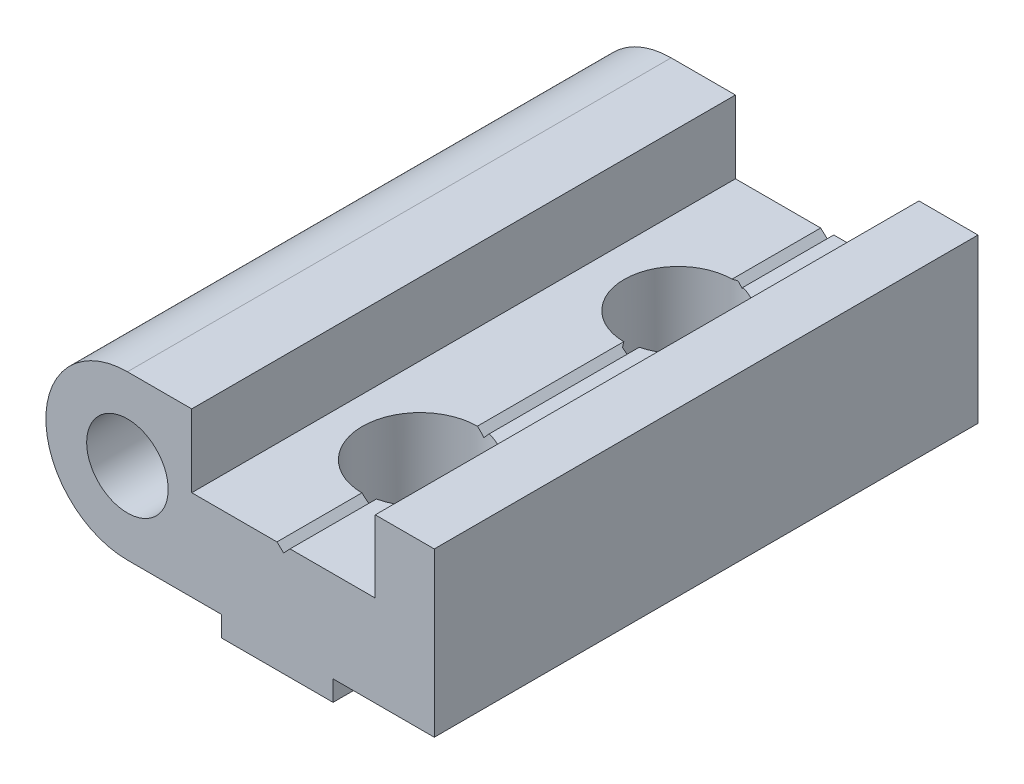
ISO-10303-21;
HEADER;
FILE_DESCRIPTION(('STEP AP214'),'2;1');
FILE_NAME('part.step','',(''),(''),'','','');
FILE_SCHEMA(('AUTOMOTIVE_DESIGN { 1 0 10303 214 1 1 1 1 }'));
ENDSEC;
DATA;
#1=APPLICATION_CONTEXT('core data for automotive mechanical design processes');
#2=APPLICATION_PROTOCOL_DEFINITION('international standard','automotive_design',2000,#1);
#3=PRODUCT_CONTEXT('',#1,'mechanical');
#4=PRODUCT('Part','Part','',(#3));
#5=PRODUCT_RELATED_PRODUCT_CATEGORY('part','',(#4));
#6=PRODUCT_DEFINITION_FORMATION('','',#4);
#7=PRODUCT_DEFINITION_CONTEXT('part definition',#1,'design');
#8=PRODUCT_DEFINITION('design','',#6,#7);
#9=PRODUCT_DEFINITION_SHAPE('','',#8);
#10=(LENGTH_UNIT() NAMED_UNIT(*) SI_UNIT(.MILLI.,.METRE.));
#11=(NAMED_UNIT(*) PLANE_ANGLE_UNIT() SI_UNIT($,.RADIAN.));
#12=(NAMED_UNIT(*) SI_UNIT($,.STERADIAN.) SOLID_ANGLE_UNIT());
#13=UNCERTAINTY_MEASURE_WITH_UNIT(LENGTH_MEASURE(1.E-05),#10,'distance_accuracy_value','');
#14=(GEOMETRIC_REPRESENTATION_CONTEXT(3) GLOBAL_UNCERTAINTY_ASSIGNED_CONTEXT((#13)) GLOBAL_UNIT_ASSIGNED_CONTEXT((#10,
#11,#12)) REPRESENTATION_CONTEXT('',''));
#15=CARTESIAN_POINT('',(0.,0.,0.));
#16=DIRECTION('',(0.,0.,1.));
#17=DIRECTION('',(1.,0.,0.));
#18=AXIS2_PLACEMENT_3D('',#15,#16,#17);
#19=CARTESIAN_POINT('',(-0.47077716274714,-1.5,-29.5));
#20=DIRECTION('',(0.,-1.,0.));
#21=DIRECTION('',(0.,0.,-1.));
#22=AXIS2_PLACEMENT_3D('',#19,#20,#21);
#23=CONICAL_SURFACE('',#22,5.25,0.785398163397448);
#24=CARTESIAN_POINT('',(-0.47077716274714,-0.500000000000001,-29.5));
#25=DIRECTION('',(0.,1.,0.));
#26=DIRECTION('',(0.,0.,1.));
#27=AXIS2_PLACEMENT_3D('',#24,#25,#26);
#28=CIRCLE('',#27,4.25);
#29=CARTESIAN_POINT('',(-4.57077716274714,-0.5,-28.38084853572));
#30=VERTEX_POINT('',#29);
#31=CARTESIAN_POINT('',(3.62922283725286,-0.500000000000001,-28.38084853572));
#32=VERTEX_POINT('',#31);
#33=EDGE_CURVE('E379',#30,#32,#28,.T.);
#34=ORIENTED_EDGE('',*,*,#33,.T.);
#35=CARTESIAN_POINT('',(3.62922283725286,-1.5,-26.2208995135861));
#36=CARTESIAN_POINT('',(3.62922283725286,-1.44719052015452,-26.3054610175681));
#37=CARTESIAN_POINT('',(3.62922283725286,-1.39526598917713,-26.3905770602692));
#38=CARTESIAN_POINT('',(3.62922283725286,-1.29348299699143,-26.5620593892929));
#39=CARTESIAN_POINT('',(3.62922283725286,-1.24362499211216,-26.6484259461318));
#40=CARTESIAN_POINT('',(3.62922283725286,-1.09817894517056,-26.9085744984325));
#41=CARTESIAN_POINT('',(3.62922283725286,-1.00611575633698,-27.0843575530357));
#42=CARTESIAN_POINT('',(3.62922283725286,-0.834595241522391,-27.4425135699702));
#43=CARTESIAN_POINT('',(3.62922283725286,-0.755161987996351,-27.6248983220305));
#44=CARTESIAN_POINT('',(3.62922283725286,-0.648856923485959,-27.9039513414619));
#45=CARTESIAN_POINT('',(3.62922283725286,-0.615489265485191,-27.9981466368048));
#46=CARTESIAN_POINT('',(3.62922283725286,-0.553789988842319,-28.1882430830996));
#47=CARTESIAN_POINT('',(3.62922283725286,-0.525462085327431,-28.2841454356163));
#48=CARTESIAN_POINT('',(3.62922283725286,-0.500000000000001,-28.38084853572));
#49=B_SPLINE_CURVE_WITH_KNOTS('',3,(#35,#36,#37,#38,#39,#40,#41,#42,#43,#44,#45,#46,#47,#48),
.UNSPECIFIED.,.F.,.F.,(4,2,2,2,2,2,4),(0.,0.299084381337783,0.598234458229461,1.19315738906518,
1.78920098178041,2.08886510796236,2.38874922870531),.UNSPECIFIED.);
#50=CARTESIAN_POINT('',(3.62922283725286,-1.5,-26.2208995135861));
#51=VERTEX_POINT('',#50);
#52=EDGE_CURVE('E177',#51,#32,#49,.T.);
#53=ORIENTED_EDGE('',*,*,#52,.F.);
#54=CARTESIAN_POINT('',(-0.47077716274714,-1.5,-29.5));
#55=DIRECTION('',(0.,-1.,0.));
#56=DIRECTION('',(0.,0.,-1.));
#57=AXIS2_PLACEMENT_3D('',#54,#55,#56);
#58=CIRCLE('',#57,5.25);
#59=CARTESIAN_POINT('',(-4.57077716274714,-1.5,-26.2208995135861));
#60=VERTEX_POINT('',#59);
#61=EDGE_CURVE('E20',#60,#51,#58,.F.);
#62=ORIENTED_EDGE('',*,*,#61,.F.);
#63=CARTESIAN_POINT('',(-4.57077716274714,-0.500000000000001,-28.38084853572));
#64=CARTESIAN_POINT('',(-4.57077716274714,-0.525462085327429,-28.2841454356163));
#65=CARTESIAN_POINT('',(-4.57077716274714,-0.553789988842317,-28.1882430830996));
#66=CARTESIAN_POINT('',(-4.57077716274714,-0.615489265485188,-27.9981466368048));
#67=CARTESIAN_POINT('',(-4.57077716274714,-0.648856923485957,-27.9039513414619));
#68=CARTESIAN_POINT('',(-4.57077716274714,-0.755161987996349,-27.6248983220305));
#69=CARTESIAN_POINT('',(-4.57077716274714,-0.83459524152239,-27.4425135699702));
#70=CARTESIAN_POINT('',(-4.57077716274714,-1.00611575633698,-27.0843575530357));
#71=CARTESIAN_POINT('',(-4.57077716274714,-1.09817894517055,-26.9085744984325));
#72=CARTESIAN_POINT('',(-4.57077716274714,-1.24362499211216,-26.6484259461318));
#73=CARTESIAN_POINT('',(-4.57077716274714,-1.29348299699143,-26.5620593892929));
#74=CARTESIAN_POINT('',(-4.57077716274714,-1.39526598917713,-26.3905770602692));
#75=CARTESIAN_POINT('',(-4.57077716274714,-1.44719052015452,-26.3054610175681));
#76=CARTESIAN_POINT('',(-4.57077716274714,-1.5,-26.2208995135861));
#77=B_SPLINE_CURVE_WITH_KNOTS('',3,(#63,#64,#65,#66,#67,#68,#69,#70,#71,#72,#73,#74,#75,#76),
.UNSPECIFIED.,.F.,.F.,(4,2,2,2,2,2,4),(0.,0.299884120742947,0.599548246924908,1.19559183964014,
1.79051477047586,2.08966484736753,2.38874922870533),.UNSPECIFIED.);
#78=EDGE_CURVE('E174',#30,#60,#77,.T.);
#79=ORIENTED_EDGE('',*,*,#78,.F.);
#80=EDGE_LOOP('',(#34,#53,#62,#79));
#81=FACE_BOUND('',#80,.T.);
#82=ADVANCED_FACE('F16',(#81),#23,.F.);
#83=CARTESIAN_POINT('',(-4.57077716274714,-1.5,0.));
#84=DIRECTION('',(0.,-1.,0.));
#85=DIRECTION('',(0.,0.,-1.));
#86=AXIS2_PLACEMENT_3D('',#83,#84,#85);
#87=PLANE('',#86);
#88=CARTESIAN_POINT('',(-0.470777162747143,-1.5,-10.5));
#89=DIRECTION('',(0.,-1.,0.));
#90=DIRECTION('',(0.,0.,-1.));
#91=AXIS2_PLACEMENT_3D('',#88,#89,#90);
#92=CIRCLE('',#91,5.25);
#93=CARTESIAN_POINT('',(3.62922283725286,-1.5,-13.7791004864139));
#94=VERTEX_POINT('',#93);
#95=CARTESIAN_POINT('',(-4.57077716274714,-1.5,-13.7791004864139));
#96=VERTEX_POINT('',#95);
#97=EDGE_CURVE('E181',#94,#96,#92,.F.);
#98=ORIENTED_EDGE('',*,*,#97,.T.);
#99=DIRECTION('',(0.,0.,1.));
#100=VECTOR('',#99,1.);
#101=CARTESIAN_POINT('',(-4.57077716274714,-1.5,0.));
#102=LINE('',#101,#100);
#103=EDGE_CURVE('E183',#60,#96,#102,.T.);
#104=ORIENTED_EDGE('',*,*,#103,.F.);
#105=ORIENTED_EDGE('',*,*,#61,.T.);
#106=DIRECTION('',(0.,0.,-1.));
#107=VECTOR('',#106,1.);
#108=CARTESIAN_POINT('',(3.62922283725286,-1.5,0.));
#109=LINE('',#108,#107);
#110=EDGE_CURVE('E358',#94,#51,#109,.T.);
#111=ORIENTED_EDGE('',*,*,#110,.F.);
#112=EDGE_LOOP('',(#98,#104,#105,#111));
#113=FACE_BOUND('',#112,.T.);
#114=ADVANCED_FACE('F184',(#113),#87,.T.);
#115=CARTESIAN_POINT('',(-0.470777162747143,-1.5,-10.5));
#116=DIRECTION('',(0.,-1.,0.));
#117=DIRECTION('',(0.,0.,-1.));
#118=AXIS2_PLACEMENT_3D('',#115,#116,#117);
#119=CONICAL_SURFACE('',#118,5.25,0.785398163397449);
#120=CARTESIAN_POINT('',(-0.47077716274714,-0.500000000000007,-10.5));
#121=DIRECTION('',(0.,1.,0.));
#122=DIRECTION('',(-1.,0.,0.));
#123=AXIS2_PLACEMENT_3D('',#120,#121,#122);
#124=CIRCLE('',#123,4.25);
#125=CARTESIAN_POINT('',(3.62922283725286,-0.500000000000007,-11.61915146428));
#126=VERTEX_POINT('',#125);
#127=CARTESIAN_POINT('',(-4.57077716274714,-0.500000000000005,-11.61915146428));
#128=VERTEX_POINT('',#127);
#129=EDGE_CURVE('E295',#126,#128,#124,.T.);
#130=ORIENTED_EDGE('',*,*,#129,.T.);
#131=CARTESIAN_POINT('',(-4.57077716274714,-1.5,-13.7791004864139));
#132=CARTESIAN_POINT('',(-4.57077716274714,-1.44719052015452,-13.6945389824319));
#133=CARTESIAN_POINT('',(-4.57077716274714,-1.39526598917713,-13.6094229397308));
#134=CARTESIAN_POINT('',(-4.57077716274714,-1.29348299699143,-13.4379406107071));
#135=CARTESIAN_POINT('',(-4.57077716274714,-1.24362499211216,-13.3515740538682));
#136=CARTESIAN_POINT('',(-4.57077716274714,-1.09817894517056,-13.0914255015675));
#137=CARTESIAN_POINT('',(-4.57077716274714,-1.00611575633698,-12.9156424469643));
#138=CARTESIAN_POINT('',(-4.57077716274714,-0.83459524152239,-12.5574864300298));
#139=CARTESIAN_POINT('',(-4.57077716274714,-0.75516198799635,-12.3751016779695));
#140=CARTESIAN_POINT('',(-4.57077716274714,-0.648856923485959,-12.0960486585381));
#141=CARTESIAN_POINT('',(-4.57077716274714,-0.61548926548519,-12.0018533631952));
#142=CARTESIAN_POINT('',(-4.57077716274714,-0.553789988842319,-11.8117569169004));
#143=CARTESIAN_POINT('',(-4.57077716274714,-0.525462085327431,-11.7158545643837));
#144=CARTESIAN_POINT('',(-4.57077716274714,-0.500000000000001,-11.61915146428));
#145=B_SPLINE_CURVE_WITH_KNOTS('',3,(#131,#132,#133,#134,#135,#136,#137,#138,#139,#140,#141,
#142,#143,#144),.UNSPECIFIED.,.F.,.F.,(4,2,2,2,2,2,4),(0.,0.299084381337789,0.598234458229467,
1.19315738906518,1.78920098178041,2.08886510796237,2.38874922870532),.UNSPECIFIED.);
#146=EDGE_CURVE('E188',#96,#128,#145,.T.);
#147=ORIENTED_EDGE('',*,*,#146,.F.);
#148=ORIENTED_EDGE('',*,*,#97,.F.);
#149=CARTESIAN_POINT('',(3.62922283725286,-0.500000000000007,-11.61915146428));
#150=CARTESIAN_POINT('',(3.62922283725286,-0.525462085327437,-11.7158545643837));
#151=CARTESIAN_POINT('',(3.62922283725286,-0.553789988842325,-11.8117569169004));
#152=CARTESIAN_POINT('',(3.62922283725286,-0.615489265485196,-12.0018533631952));
#153=CARTESIAN_POINT('',(3.62922283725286,-0.648856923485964,-12.0960486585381));
#154=CARTESIAN_POINT('',(3.62922283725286,-0.755161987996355,-12.3751016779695));
#155=CARTESIAN_POINT('',(3.62922283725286,-0.834595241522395,-12.5574864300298));
#156=CARTESIAN_POINT('',(3.62922283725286,-1.00611575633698,-12.9156424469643));
#157=CARTESIAN_POINT('',(3.62922283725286,-1.09817894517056,-13.0914255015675));
#158=CARTESIAN_POINT('',(3.62922283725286,-1.24362499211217,-13.3515740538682));
#159=CARTESIAN_POINT('',(3.62922283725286,-1.29348299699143,-13.4379406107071));
#160=CARTESIAN_POINT('',(3.62922283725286,-1.39526598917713,-13.6094229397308));
#161=CARTESIAN_POINT('',(3.62922283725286,-1.44719052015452,-13.6945389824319));
#162=CARTESIAN_POINT('',(3.62922283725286,-1.50000000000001,-13.7791004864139));
#163=B_SPLINE_CURVE_WITH_KNOTS('',3,(#149,#150,#151,#152,#153,#154,#155,#156,#157,#158,#159,
#160,#161,#162),.UNSPECIFIED.,.F.,.F.,(4,2,2,2,2,2,4),(0.,0.29988412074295,0.599548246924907,
1.19559183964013,1.79051477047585,2.08966484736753,2.38874922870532),.UNSPECIFIED.);
#164=EDGE_CURVE('E360',#126,#94,#163,.T.);
#165=ORIENTED_EDGE('',*,*,#164,.F.);
#166=EDGE_LOOP('',(#130,#147,#148,#165));
#167=FACE_BOUND('',#166,.T.);
#168=ADVANCED_FACE('F684',(#167),#119,.F.);
#169=CARTESIAN_POINT('',(-0.47077716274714,-1.5,-29.5));
#170=DIRECTION('',(0.,-1.,0.));
#171=DIRECTION('',(0.,0.,-1.));
#172=AXIS2_PLACEMENT_3D('',#169,#170,#171);
#173=CONICAL_SURFACE('',#172,5.25,0.785398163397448);
#174=CARTESIAN_POINT('',(-0.47077716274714,-1.5,-29.5));
#175=DIRECTION('',(0.,-1.,0.));
#176=DIRECTION('',(0.,0.,-1.));
#177=AXIS2_PLACEMENT_3D('',#174,#175,#176);
#178=CIRCLE('',#177,5.25);
#179=CARTESIAN_POINT('',(3.62922283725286,-1.5,-32.7791004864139));
#180=VERTEX_POINT('',#179);
#181=CARTESIAN_POINT('',(-4.57077716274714,-1.5,-32.7791004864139));
#182=VERTEX_POINT('',#181);
#183=EDGE_CURVE('E243',#180,#182,#178,.F.);
#184=ORIENTED_EDGE('',*,*,#183,.F.);
#185=CARTESIAN_POINT('',(3.62922283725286,-0.500000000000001,-30.61915146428));
#186=CARTESIAN_POINT('',(3.62922283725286,-0.52546208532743,-30.7158545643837));
#187=CARTESIAN_POINT('',(3.62922283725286,-0.553789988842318,-30.8117569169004));
#188=CARTESIAN_POINT('',(3.62922283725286,-0.61548926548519,-31.0018533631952));
#189=CARTESIAN_POINT('',(3.62922283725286,-0.648856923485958,-31.0960486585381));
#190=CARTESIAN_POINT('',(3.62922283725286,-0.75516198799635,-31.3751016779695));
#191=CARTESIAN_POINT('',(3.62922283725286,-0.834595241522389,-31.5574864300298));
#192=CARTESIAN_POINT('',(3.62922283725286,-1.00611575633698,-31.9156424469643));
#193=CARTESIAN_POINT('',(3.62922283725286,-1.09817894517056,-32.0914255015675));
#194=CARTESIAN_POINT('',(3.62922283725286,-1.24362499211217,-32.3515740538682));
#195=CARTESIAN_POINT('',(3.62922283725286,-1.29348299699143,-32.4379406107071));
#196=CARTESIAN_POINT('',(3.62922283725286,-1.39526598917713,-32.6094229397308));
#197=CARTESIAN_POINT('',(3.62922283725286,-1.44719052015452,-32.6945389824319));
#198=CARTESIAN_POINT('',(3.62922283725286,-1.5,-32.7791004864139));
#199=B_SPLINE_CURVE_WITH_KNOTS('',3,(#185,#186,#187,#188,#189,#190,#191,#192,#193,#194,#195,
#196,#197,#198),.UNSPECIFIED.,.F.,.F.,(4,2,2,2,2,2,4),(0.,0.299884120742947,0.599548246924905,
1.19559183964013,1.79051477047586,2.08966484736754,2.38874922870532),.UNSPECIFIED.);
#200=CARTESIAN_POINT('',(3.62922283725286,-0.500000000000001,-30.61915146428));
#201=VERTEX_POINT('',#200);
#202=EDGE_CURVE('E372',#201,#180,#199,.T.);
#203=ORIENTED_EDGE('',*,*,#202,.F.);
#204=CARTESIAN_POINT('',(-0.47077716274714,-0.500000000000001,-29.5));
#205=DIRECTION('',(0.,1.,0.));
#206=DIRECTION('',(0.,0.,1.));
#207=AXIS2_PLACEMENT_3D('',#204,#205,#206);
#208=CIRCLE('',#207,4.25);
#209=CARTESIAN_POINT('',(-4.57077716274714,-0.500000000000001,-30.61915146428));
#210=VERTEX_POINT('',#209);
#211=EDGE_CURVE('E194',#201,#210,#208,.T.);
#212=ORIENTED_EDGE('',*,*,#211,.T.);
#213=CARTESIAN_POINT('',(-4.57077716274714,-1.5,-32.7791004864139));
#214=CARTESIAN_POINT('',(-4.57077716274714,-1.44719052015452,-32.6945389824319));
#215=CARTESIAN_POINT('',(-4.57077716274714,-1.39526598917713,-32.6094229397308));
#216=CARTESIAN_POINT('',(-4.57077716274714,-1.29348299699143,-32.4379406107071));
#217=CARTESIAN_POINT('',(-4.57077716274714,-1.24362499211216,-32.3515740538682));
#218=CARTESIAN_POINT('',(-4.57077716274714,-1.09817894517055,-32.0914255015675));
#219=CARTESIAN_POINT('',(-4.57077716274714,-1.00611575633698,-31.9156424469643));
#220=CARTESIAN_POINT('',(-4.57077716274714,-0.834595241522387,-31.5574864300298));
#221=CARTESIAN_POINT('',(-4.57077716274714,-0.755161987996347,-31.3751016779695));
#222=CARTESIAN_POINT('',(-4.57077716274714,-0.648856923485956,-31.0960486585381));
#223=CARTESIAN_POINT('',(-4.57077716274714,-0.615489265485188,-31.0018533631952));
#224=CARTESIAN_POINT('',(-4.57077716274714,-0.553789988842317,-30.8117569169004));
#225=CARTESIAN_POINT('',(-4.57077716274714,-0.525462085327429,-30.7158545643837));
#226=CARTESIAN_POINT('',(-4.57077716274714,-0.499999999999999,-30.61915146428));
#227=B_SPLINE_CURVE_WITH_KNOTS('',3,(#213,#214,#215,#216,#217,#218,#219,#220,#221,#222,#223,
#224,#225,#226),.UNSPECIFIED.,.F.,.F.,(4,2,2,2,2,2,4),(0.,0.299084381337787,0.598234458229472,
1.19315738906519,1.78920098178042,2.08886510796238,2.38874922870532),.UNSPECIFIED.);
#228=EDGE_CURVE('E269',#182,#210,#227,.T.);
#229=ORIENTED_EDGE('',*,*,#228,.F.);
#230=EDGE_LOOP('',(#184,#203,#212,#229));
#231=FACE_BOUND('',#230,.T.);
#232=ADVANCED_FACE('F681',(#231),#173,.F.);
#233=CARTESIAN_POINT('',(3.62922283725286,-1.5,0.));
#234=DIRECTION('',(1.,0.,0.));
#235=DIRECTION('',(0.,0.,-1.));
#236=AXIS2_PLACEMENT_3D('',#233,#234,#235);
#237=PLANE('',#236);
#238=DIRECTION('',(0.,0.,-1.));
#239=VECTOR('',#238,1.);
#240=CARTESIAN_POINT('',(3.62922283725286,0.,0.));
#241=LINE('',#240,#239);
#242=CARTESIAN_POINT('',(3.62922283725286,0.,-30.61915146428));
#243=VERTEX_POINT('',#242);
#244=CARTESIAN_POINT('',(3.62922283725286,0.,-40.));
#245=VERTEX_POINT('',#244);
#246=EDGE_CURVE('E438',#243,#245,#241,.T.);
#247=ORIENTED_EDGE('',*,*,#246,.F.);
#248=DIRECTION('',(0.,-1.,0.));
#249=VECTOR('',#248,1.);
#250=CARTESIAN_POINT('',(3.62922283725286,3.,-30.61915146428));
#251=LINE('',#250,#249);
#252=EDGE_CURVE('E378',#243,#201,#251,.T.);
#253=ORIENTED_EDGE('',*,*,#252,.T.);
#254=ORIENTED_EDGE('',*,*,#202,.T.);
#255=DIRECTION('',(0.,0.,-1.));
#256=VECTOR('',#255,1.);
#257=CARTESIAN_POINT('',(3.62922283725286,-1.5,0.));
#258=LINE('',#257,#256);
#259=CARTESIAN_POINT('',(3.62922283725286,-1.5,-40.));
#260=VERTEX_POINT('',#259);
#261=EDGE_CURVE('E306',#260,#180,#258,.F.);
#262=ORIENTED_EDGE('',*,*,#261,.F.);
#263=DIRECTION('',(0.,1.,0.));
#264=VECTOR('',#263,1.);
#265=CARTESIAN_POINT('',(3.62922283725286,-1.5,-40.));
#266=LINE('',#265,#264);
#267=EDGE_CURVE('E369',#260,#245,#266,.T.);
#268=ORIENTED_EDGE('',*,*,#267,.T.);
#269=EDGE_LOOP('',(#247,#253,#254,#262,#268));
#270=FACE_BOUND('',#269,.T.);
#271=ADVANCED_FACE('F665',(#270),#237,.T.);
#272=CARTESIAN_POINT('',(3.62922283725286,-1.5,0.));
#273=DIRECTION('',(1.,0.,0.));
#274=DIRECTION('',(0.,0.,-1.));
#275=AXIS2_PLACEMENT_3D('',#272,#273,#274);
#276=PLANE('',#275);
#277=ORIENTED_EDGE('',*,*,#164,.T.);
#278=ORIENTED_EDGE('',*,*,#110,.T.);
#279=ORIENTED_EDGE('',*,*,#52,.T.);
#280=DIRECTION('',(0.,1.,0.));
#281=VECTOR('',#280,1.);
#282=CARTESIAN_POINT('',(3.62922283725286,3.,-28.38084853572));
#283=LINE('',#282,#281);
#284=CARTESIAN_POINT('',(3.62922283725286,0.,-28.38084853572));
#285=VERTEX_POINT('',#284);
#286=EDGE_CURVE('E376',#32,#285,#283,.T.);
#287=ORIENTED_EDGE('',*,*,#286,.T.);
#288=DIRECTION('',(0.,0.,-1.));
#289=VECTOR('',#288,1.);
#290=CARTESIAN_POINT('',(3.62922283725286,0.,0.));
#291=LINE('',#290,#289);
#292=CARTESIAN_POINT('',(3.62922283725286,0.,-11.61915146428));
#293=VERTEX_POINT('',#292);
#294=EDGE_CURVE('E434',#293,#285,#291,.T.);
#295=ORIENTED_EDGE('',*,*,#294,.F.);
#296=DIRECTION('',(0.,-1.,0.));
#297=VECTOR('',#296,1.);
#298=CARTESIAN_POINT('',(3.62922283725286,3.09856098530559,-11.61915146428));
#299=LINE('',#298,#297);
#300=EDGE_CURVE('E277',#293,#126,#299,.T.);
#301=ORIENTED_EDGE('',*,*,#300,.T.);
#302=EDGE_LOOP('',(#277,#278,#279,#287,#295,#301));
#303=FACE_BOUND('',#302,.T.);
#304=ADVANCED_FACE('F661',(#303),#276,.T.);
#305=CARTESIAN_POINT('',(-0.47077716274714,6.5,-29.5));
#306=DIRECTION('',(0.,-1.,0.));
#307=DIRECTION('',(0.,0.,-1.));
#308=AXIS2_PLACEMENT_3D('',#305,#306,#307);
#309=CONICAL_SURFACE('',#308,4.25,1.02974425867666);
#310=CARTESIAN_POINT('',(-0.47077716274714,6.5,-29.5));
#311=DIRECTION('',(0.,-1.,0.));
#312=DIRECTION('',(1.,0.,0.));
#313=AXIS2_PLACEMENT_3D('',#310,#311,#312);
#314=CIRCLE('',#313,4.25);
#315=CARTESIAN_POINT('',(0.280575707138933,6.5,-33.6830573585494));
#316=VERTEX_POINT('',#315);
#317=CARTESIAN_POINT('',(0.280575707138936,6.5,-25.3169426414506));
#318=VERTEX_POINT('',#317);
#319=EDGE_CURVE('E387',#316,#318,#314,.T.);
#320=ORIENTED_EDGE('',*,*,#319,.T.);
#321=CARTESIAN_POINT('',(0.463182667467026,6.69712197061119,-25.6908944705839));
#322=CARTESIAN_POINT('',(0.43318842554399,6.66474355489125,-25.6281035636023));
#323=CARTESIAN_POINT('',(0.402974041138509,6.63212749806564,-25.565545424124));
#324=CARTESIAN_POINT('',(0.34210505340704,6.5664201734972,-25.4408948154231));
#325=CARTESIAN_POINT('',(0.311450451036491,6.53332890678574,-25.3788023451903));
#326=CARTESIAN_POINT('',(0.280575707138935,6.5,-25.3169426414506));
#327=B_SPLINE_CURVE_WITH_KNOTS('',3,(#321,#322,#323,#324,#325,#326),.UNSPECIFIED.,.F.,.F.,(4,2,
4),(0.,0.230243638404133,0.460486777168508),.UNSPECIFIED.);
#328=CARTESIAN_POINT('',(0.463182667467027,6.69712197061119,-25.6908944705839));
#329=VERTEX_POINT('',#328);
#330=EDGE_CURVE('E352',#329,#318,#327,.T.);
#331=ORIENTED_EDGE('',*,*,#330,.F.);
#332=CARTESIAN_POINT('',(-0.47077716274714,6.69712197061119,-29.5));
#333=DIRECTION('',(0.,1.,0.));
#334=DIRECTION('',(0.,0.,1.));
#335=AXIS2_PLACEMENT_3D('',#332,#333,#334);
#336=CIRCLE('',#335,3.9219339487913);
#337=CARTESIAN_POINT('',(0.463182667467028,6.69712197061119,-33.3091055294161));
#338=VERTEX_POINT('',#337);
#339=EDGE_CURVE('E428',#338,#329,#336,.F.);
#340=ORIENTED_EDGE('',*,*,#339,.F.);
#341=CARTESIAN_POINT('',(0.280575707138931,6.5,-33.6830573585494));
#342=CARTESIAN_POINT('',(0.311450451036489,6.53332890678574,-33.6211976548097));
#343=CARTESIAN_POINT('',(0.34210505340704,6.5664201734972,-33.5591051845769));
#344=CARTESIAN_POINT('',(0.402974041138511,6.63212749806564,-33.434454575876));
#345=CARTESIAN_POINT('',(0.433188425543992,6.66474355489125,-33.3718964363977));
#346=CARTESIAN_POINT('',(0.463182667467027,6.69712197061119,-33.3091055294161));
#347=B_SPLINE_CURVE_WITH_KNOTS('',3,(#341,#342,#343,#344,#345,#346),.UNSPECIFIED.,.F.,.F.,(4,2,
4),(0.,0.230243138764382,0.460486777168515),.UNSPECIFIED.);
#348=EDGE_CURVE('E345',#316,#338,#347,.T.);
#349=ORIENTED_EDGE('',*,*,#348,.F.);
#350=EDGE_LOOP('',(#320,#331,#340,#349));
#351=FACE_BOUND('',#350,.T.);
#352=ADVANCED_FACE('F647',(#351),#309,.F.);
#353=CARTESIAN_POINT('',(0.463182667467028,6.69712197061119,0.));
#354=DIRECTION('',(-0.733599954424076,0.679581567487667,0.));
#355=DIRECTION('',(-0.679581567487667,-0.733599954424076,0.));
#356=AXIS2_PLACEMENT_3D('',#353,#354,#355);
#357=PLANE('',#356);
#358=DIRECTION('',(0.,0.,1.));
#359=VECTOR('',#358,1.);
#360=CARTESIAN_POINT('',(0.463182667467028,6.69712197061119,0.));
#361=LINE('',#360,#359);
#362=CARTESIAN_POINT('',(0.463182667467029,6.69712197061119,-14.6461089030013));
#363=VERTEX_POINT('',#362);
#364=EDGE_CURVE('E427',#329,#363,#361,.T.);
#365=ORIENTED_EDGE('',*,*,#364,.F.);
#366=ORIENTED_EDGE('',*,*,#330,.T.);
#367=CARTESIAN_POINT('',(-0.47077716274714,5.68892380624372,-29.5));
#368=DIRECTION('',(-0.733599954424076,0.679581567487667,0.));
#369=DIRECTION('',(0.679581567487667,0.733599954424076,0.));
#370=AXIS2_PLACEMENT_3D('',#367,#368,#369);
#371=ELLIPSE('',#370,6.25384825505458,4.25);
#372=CARTESIAN_POINT('',(0.,6.19712197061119,-25.2761547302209));
#373=VERTEX_POINT('',#372);
#374=EDGE_CURVE('E389',#318,#373,#371,.F.);
#375=ORIENTED_EDGE('',*,*,#374,.T.);
#376=DIRECTION('',(0.,0.,1.));
#377=VECTOR('',#376,1.);
#378=CARTESIAN_POINT('',(0.,6.19712197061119,0.));
#379=LINE('',#378,#377);
#380=CARTESIAN_POINT('',(0.,6.19712197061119,-14.7238452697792));
#381=VERTEX_POINT('',#380);
#382=EDGE_CURVE('E327',#381,#373,#379,.F.);
#383=ORIENTED_EDGE('',*,*,#382,.F.);
#384=CARTESIAN_POINT('',(-0.47077716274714,5.68892380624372,-10.5));
#385=DIRECTION('',(-0.733599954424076,0.679581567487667,0.));
#386=DIRECTION('',(0.679581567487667,0.733599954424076,0.));
#387=AXIS2_PLACEMENT_3D('',#384,#385,#386);
#388=ELLIPSE('',#387,6.25384825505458,4.25);
#389=EDGE_CURVE('E275',#381,#363,#388,.F.);
#390=ORIENTED_EDGE('',*,*,#389,.T.);
#391=EDGE_LOOP('',(#365,#366,#375,#383,#390));
#392=FACE_BOUND('',#391,.T.);
#393=ADVANCED_FACE('F656',(#392),#357,.T.);
#394=CARTESIAN_POINT('',(0.463182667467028,6.69712197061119,0.));
#395=DIRECTION('',(-0.733599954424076,0.679581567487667,0.));
#396=DIRECTION('',(-0.679581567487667,-0.733599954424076,0.));
#397=AXIS2_PLACEMENT_3D('',#394,#395,#396);
#398=PLANE('',#397);
#399=DIRECTION('',(-0.679581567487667,-0.733599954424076,0.));
#400=VECTOR('',#399,1.);
#401=CARTESIAN_POINT('',(0.463182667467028,6.69712197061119,0.));
#402=LINE('',#401,#400);
#403=CARTESIAN_POINT('',(0.,6.19712197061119,0.));
#404=VERTEX_POINT('',#403);
#405=CARTESIAN_POINT('',(0.463182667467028,6.69712197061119,0.));
#406=VERTEX_POINT('',#405);
#407=EDGE_CURVE('E349',#404,#406,#402,.F.);
#408=ORIENTED_EDGE('',*,*,#407,.T.);
#409=DIRECTION('',(0.,0.,1.));
#410=VECTOR('',#409,1.);
#411=CARTESIAN_POINT('',(0.463182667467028,6.69712197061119,0.));
#412=LINE('',#411,#410);
#413=CARTESIAN_POINT('',(0.463182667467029,6.69712197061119,-6.35389109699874));
#414=VERTEX_POINT('',#413);
#415=EDGE_CURVE('E426',#414,#406,#412,.T.);
#416=ORIENTED_EDGE('',*,*,#415,.F.);
#417=CARTESIAN_POINT('',(-0.47077716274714,5.68892380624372,-10.5));
#418=DIRECTION('',(-0.733599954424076,0.679581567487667,0.));
#419=DIRECTION('',(0.679581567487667,0.733599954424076,0.));
#420=AXIS2_PLACEMENT_3D('',#417,#418,#419);
#421=ELLIPSE('',#420,6.25384825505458,4.25);
#422=CARTESIAN_POINT('',(0.,6.19712197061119,-6.27615473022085));
#423=VERTEX_POINT('',#422);
#424=EDGE_CURVE('E282',#414,#423,#421,.F.);
#425=ORIENTED_EDGE('',*,*,#424,.T.);
#426=DIRECTION('',(0.,0.,1.));
#427=VECTOR('',#426,1.);
#428=CARTESIAN_POINT('',(0.,6.19712197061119,0.));
#429=LINE('',#428,#427);
#430=EDGE_CURVE('E330',#404,#423,#429,.F.);
#431=ORIENTED_EDGE('',*,*,#430,.F.);
#432=EDGE_LOOP('',(#408,#416,#425,#431));
#433=FACE_BOUND('',#432,.T.);
#434=ADVANCED_FACE('F652',(#433),#398,.T.);
#435=CARTESIAN_POINT('',(0.463182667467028,6.69712197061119,0.));
#436=DIRECTION('',(-0.733599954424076,0.679581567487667,0.));
#437=DIRECTION('',(-0.679581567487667,-0.733599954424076,0.));
#438=AXIS2_PLACEMENT_3D('',#435,#436,#437);
#439=PLANE('',#438);
#440=DIRECTION('',(-0.679581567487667,-0.733599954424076,0.));
#441=VECTOR('',#440,1.);
#442=CARTESIAN_POINT('',(0.463182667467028,6.69712197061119,-40.));
#443=LINE('',#442,#441);
#444=CARTESIAN_POINT('',(0.463182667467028,6.69712197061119,-40.));
#445=VERTEX_POINT('',#444);
#446=CARTESIAN_POINT('',(0.,6.19712197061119,-40.));
#447=VERTEX_POINT('',#446);
#448=EDGE_CURVE('E342',#445,#447,#443,.T.);
#449=ORIENTED_EDGE('',*,*,#448,.T.);
#450=DIRECTION('',(0.,0.,1.));
#451=VECTOR('',#450,1.);
#452=CARTESIAN_POINT('',(0.,6.19712197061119,0.));
#453=LINE('',#452,#451);
#454=CARTESIAN_POINT('',(0.,6.19712197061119,-33.7238452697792));
#455=VERTEX_POINT('',#454);
#456=EDGE_CURVE('E336',#455,#447,#453,.F.);
#457=ORIENTED_EDGE('',*,*,#456,.F.);
#458=CARTESIAN_POINT('',(-0.47077716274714,5.68892380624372,-29.5));
#459=DIRECTION('',(-0.733599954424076,0.679581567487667,0.));
#460=DIRECTION('',(0.679581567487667,0.733599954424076,0.));
#461=AXIS2_PLACEMENT_3D('',#458,#459,#460);
#462=ELLIPSE('',#461,6.25384825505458,4.25);
#463=EDGE_CURVE('E309',#455,#316,#462,.F.);
#464=ORIENTED_EDGE('',*,*,#463,.T.);
#465=ORIENTED_EDGE('',*,*,#348,.T.);
#466=DIRECTION('',(0.,0.,1.));
#467=VECTOR('',#466,1.);
#468=CARTESIAN_POINT('',(0.463182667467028,6.69712197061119,0.));
#469=LINE('',#468,#467);
#470=EDGE_CURVE('E422',#445,#338,#469,.T.);
#471=ORIENTED_EDGE('',*,*,#470,.F.);
#472=EDGE_LOOP('',(#449,#457,#464,#465,#471));
#473=FACE_BOUND('',#472,.T.);
#474=ADVANCED_FACE('F627',(#473),#439,.T.);
#475=CARTESIAN_POINT('',(-0.47077716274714,6.5,-29.5));
#476=DIRECTION('',(0.,-1.,0.));
#477=DIRECTION('',(0.,0.,-1.));
#478=AXIS2_PLACEMENT_3D('',#475,#476,#477);
#479=CONICAL_SURFACE('',#478,4.25,1.02974425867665);
#480=CARTESIAN_POINT('',(-0.47077716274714,6.66030463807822,-29.5));
#481=DIRECTION('',(0.,1.,0.));
#482=DIRECTION('',(0.,0.,1.));
#483=AXIS2_PLACEMENT_3D('',#480,#481,#482);
#484=CIRCLE('',#483,3.9832082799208);
#485=CARTESIAN_POINT('',(-0.499999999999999,6.66030463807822,-25.5168989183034));
#486=VERTEX_POINT('',#485);
#487=CARTESIAN_POINT('',(-0.499999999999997,6.66030463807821,-33.4831010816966));
#488=VERTEX_POINT('',#487);
#489=EDGE_CURVE('E418',#486,#488,#484,.F.);
#490=ORIENTED_EDGE('',*,*,#489,.F.);
#491=CARTESIAN_POINT('',(-0.326953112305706,6.5,-25.2524342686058));
#492=CARTESIAN_POINT('',(-0.356006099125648,6.52691367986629,-25.2962541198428));
#493=CARTESIAN_POINT('',(-0.384953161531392,6.55372923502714,-25.3402027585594));
#494=CARTESIAN_POINT('',(-0.442635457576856,6.60716411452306,-25.4283576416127));
#495=CARTESIAN_POINT('',(-0.47137069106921,6.63378343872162,-25.4725638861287));
#496=CARTESIAN_POINT('',(-0.5,6.66030463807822,-25.5168989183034));
#497=B_SPLINE_CURVE_WITH_KNOTS('',3,(#491,#492,#493,#494,#495,#496),.UNSPECIFIED.,.F.,.F.,(4,2,
4),(0.,0.177190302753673,0.354380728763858),.UNSPECIFIED.);
#498=CARTESIAN_POINT('',(-0.32695311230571,6.5,-25.2524342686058));
#499=VERTEX_POINT('',#498);
#500=EDGE_CURVE('E246',#499,#486,#497,.T.);
#501=ORIENTED_EDGE('',*,*,#500,.F.);
#502=CARTESIAN_POINT('',(-0.47077716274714,6.5,-29.5));
#503=DIRECTION('',(0.,-1.,0.));
#504=DIRECTION('',(1.,0.,0.));
#505=AXIS2_PLACEMENT_3D('',#502,#503,#504);
#506=CIRCLE('',#505,4.25);
#507=CARTESIAN_POINT('',(-0.326953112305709,6.5,-33.7475657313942));
#508=VERTEX_POINT('',#507);
#509=EDGE_CURVE('E384',#499,#508,#506,.T.);
#510=ORIENTED_EDGE('',*,*,#509,.T.);
#511=CARTESIAN_POINT('',(-0.499999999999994,6.66030463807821,-33.4831010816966));
#512=CARTESIAN_POINT('',(-0.471370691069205,6.63378343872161,-33.5274361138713));
#513=CARTESIAN_POINT('',(-0.442635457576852,6.60716411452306,-33.5716423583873));
#514=CARTESIAN_POINT('',(-0.384953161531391,6.55372923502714,-33.6597972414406));
#515=CARTESIAN_POINT('',(-0.356006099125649,6.52691367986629,-33.7037458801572));
#516=CARTESIAN_POINT('',(-0.326953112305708,6.5,-33.7475657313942));
#517=B_SPLINE_CURVE_WITH_KNOTS('',3,(#511,#512,#513,#514,#515,#516),.UNSPECIFIED.,.F.,.F.,(4,2,
4),(0.,0.177190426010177,0.354380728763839),.UNSPECIFIED.);
#518=EDGE_CURVE('E339',#488,#508,#517,.T.);
#519=ORIENTED_EDGE('',*,*,#518,.F.);
#520=EDGE_LOOP('',(#490,#501,#510,#519));
#521=FACE_BOUND('',#520,.T.);
#522=ADVANCED_FACE('F255',(#521),#479,.F.);
#523=CARTESIAN_POINT('',(0.,6.19712197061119,0.));
#524=DIRECTION('',(0.679581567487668,0.733599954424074,0.));
#525=DIRECTION('',(-0.733599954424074,0.679581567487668,0.));
#526=AXIS2_PLACEMENT_3D('',#523,#524,#525);
#527=PLANE('',#526);
#528=DIRECTION('',(-0.733599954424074,0.679581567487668,0.));
#529=VECTOR('',#528,1.);
#530=CARTESIAN_POINT('',(0.,6.19712197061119,-40.));
#531=LINE('',#530,#529);
#532=CARTESIAN_POINT('',(-0.5,6.66030463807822,-40.));
#533=VERTEX_POINT('',#532);
#534=EDGE_CURVE('E335',#447,#533,#531,.T.);
#535=ORIENTED_EDGE('',*,*,#534,.T.);
#536=DIRECTION('',(0.,0.,1.));
#537=VECTOR('',#536,1.);
#538=CARTESIAN_POINT('',(-0.5,6.66030463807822,0.));
#539=LINE('',#538,#537);
#540=EDGE_CURVE('E421',#488,#533,#539,.F.);
#541=ORIENTED_EDGE('',*,*,#540,.F.);
#542=ORIENTED_EDGE('',*,*,#518,.T.);
#543=CARTESIAN_POINT('',(-0.47077716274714,6.63323361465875,-29.5));
#544=DIRECTION('',(0.679581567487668,0.733599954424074,0.));
#545=DIRECTION('',(-0.733599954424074,0.679581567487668,0.));
#546=AXIS2_PLACEMENT_3D('',#543,#544,#545);
#547=ELLIPSE('',#546,5.7933482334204,4.25);
#548=EDGE_CURVE('E208',#508,#455,#547,.F.);
#549=ORIENTED_EDGE('',*,*,#548,.T.);
#550=ORIENTED_EDGE('',*,*,#456,.T.);
#551=EDGE_LOOP('',(#535,#541,#542,#549,#550));
#552=FACE_BOUND('',#551,.T.);
#553=ADVANCED_FACE('F653',(#552),#527,.T.);
#554=CARTESIAN_POINT('',(0.,6.19712197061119,0.));
#555=DIRECTION('',(0.679581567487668,0.733599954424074,0.));
#556=DIRECTION('',(-0.733599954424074,0.679581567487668,0.));
#557=AXIS2_PLACEMENT_3D('',#554,#555,#556);
#558=PLANE('',#557);
#559=DIRECTION('',(-0.733599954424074,0.679581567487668,0.));
#560=VECTOR('',#559,1.);
#561=CARTESIAN_POINT('',(0.,6.19712197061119,0.));
#562=LINE('',#561,#560);
#563=CARTESIAN_POINT('',(-0.5,6.66030463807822,0.));
#564=VERTEX_POINT('',#563);
#565=EDGE_CURVE('E332',#564,#404,#562,.F.);
#566=ORIENTED_EDGE('',*,*,#565,.T.);
#567=ORIENTED_EDGE('',*,*,#430,.T.);
#568=CARTESIAN_POINT('',(-0.47077716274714,6.63323361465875,-10.5));
#569=DIRECTION('',(0.679581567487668,0.733599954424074,0.));
#570=DIRECTION('',(-0.733599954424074,0.679581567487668,0.));
#571=AXIS2_PLACEMENT_3D('',#568,#569,#570);
#572=ELLIPSE('',#571,5.7933482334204,4.25);
#573=CARTESIAN_POINT('',(-0.5,6.66030463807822,-6.25010046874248));
#574=VERTEX_POINT('',#573);
#575=EDGE_CURVE('E281',#423,#574,#572,.F.);
#576=ORIENTED_EDGE('',*,*,#575,.T.);
#577=DIRECTION('',(0.,0.,1.));
#578=VECTOR('',#577,1.);
#579=CARTESIAN_POINT('',(-0.5,6.66030463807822,0.));
#580=LINE('',#579,#578);
#581=EDGE_CURVE('E417',#564,#574,#580,.F.);
#582=ORIENTED_EDGE('',*,*,#581,.F.);
#583=EDGE_LOOP('',(#566,#567,#576,#582));
#584=FACE_BOUND('',#583,.T.);
#585=ADVANCED_FACE('F781',(#584),#558,.T.);
#586=CARTESIAN_POINT('',(0.,6.19712197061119,0.));
#587=DIRECTION('',(0.679581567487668,0.733599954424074,0.));
#588=DIRECTION('',(-0.733599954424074,0.679581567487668,0.));
#589=AXIS2_PLACEMENT_3D('',#586,#587,#588);
#590=PLANE('',#589);
#591=ORIENTED_EDGE('',*,*,#382,.T.);
#592=CARTESIAN_POINT('',(-0.47077716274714,6.63323361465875,-29.5));
#593=DIRECTION('',(0.679581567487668,0.733599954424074,0.));
#594=DIRECTION('',(-0.733599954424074,0.679581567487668,0.));
#595=AXIS2_PLACEMENT_3D('',#592,#593,#594);
#596=ELLIPSE('',#595,5.7933482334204,4.25);
#597=EDGE_CURVE('E386',#373,#499,#596,.F.);
#598=ORIENTED_EDGE('',*,*,#597,.T.);
#599=ORIENTED_EDGE('',*,*,#500,.T.);
#600=DIRECTION('',(0.,0.,1.));
#601=VECTOR('',#600,1.);
#602=CARTESIAN_POINT('',(-0.5,6.66030463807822,0.));
#603=LINE('',#602,#601);
#604=CARTESIAN_POINT('',(-0.5,6.66030463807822,-14.7498995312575));
#605=VERTEX_POINT('',#604);
#606=EDGE_CURVE('E413',#605,#486,#603,.F.);
#607=ORIENTED_EDGE('',*,*,#606,.F.);
#608=CARTESIAN_POINT('',(-0.47077716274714,6.63323361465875,-10.5));
#609=DIRECTION('',(0.679581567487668,0.733599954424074,0.));
#610=DIRECTION('',(-0.733599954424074,0.679581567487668,0.));
#611=AXIS2_PLACEMENT_3D('',#608,#609,#610);
#612=ELLIPSE('',#611,5.7933482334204,4.25);
#613=EDGE_CURVE('E278',#605,#381,#612,.F.);
#614=ORIENTED_EDGE('',*,*,#613,.T.);
#615=EDGE_LOOP('',(#591,#598,#599,#607,#614));
#616=FACE_BOUND('',#615,.T.);
#617=ADVANCED_FACE('F231',(#616),#590,.T.);
#618=CARTESIAN_POINT('',(-0.470777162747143,-1.5,-10.5));
#619=DIRECTION('',(0.,-1.,0.));
#620=DIRECTION('',(0.,0.,-1.));
#621=AXIS2_PLACEMENT_3D('',#618,#619,#620);
#622=CONICAL_SURFACE('',#621,5.25,0.785398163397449);
#623=CARTESIAN_POINT('',(-0.470777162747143,-1.5,-10.5));
#624=DIRECTION('',(0.,-1.,0.));
#625=DIRECTION('',(0.,0.,-1.));
#626=AXIS2_PLACEMENT_3D('',#623,#624,#625);
#627=CIRCLE('',#626,5.25);
#628=CARTESIAN_POINT('',(-4.57077716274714,-1.5,-7.22089951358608));
#629=VERTEX_POINT('',#628);
#630=CARTESIAN_POINT('',(3.62922283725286,-1.5,-7.22089951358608));
#631=VERTEX_POINT('',#630);
#632=EDGE_CURVE('E409',#629,#631,#627,.F.);
#633=ORIENTED_EDGE('',*,*,#632,.F.);
#634=CARTESIAN_POINT('',(-4.57077716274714,-0.500000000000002,-9.38084853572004));
#635=CARTESIAN_POINT('',(-4.57077716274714,-0.52546208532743,-9.2841454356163));
#636=CARTESIAN_POINT('',(-4.57077716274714,-0.553789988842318,-9.18824308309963));
#637=CARTESIAN_POINT('',(-4.57077716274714,-0.615489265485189,-8.9981466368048));
#638=CARTESIAN_POINT('',(-4.57077716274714,-0.648856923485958,-8.90395134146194));
#639=CARTESIAN_POINT('',(-4.57077716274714,-0.75516198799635,-8.62489832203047));
#640=CARTESIAN_POINT('',(-4.57077716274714,-0.83459524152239,-8.44251356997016));
#641=CARTESIAN_POINT('',(-4.57077716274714,-1.00611575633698,-8.0843575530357));
#642=CARTESIAN_POINT('',(-4.57077716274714,-1.09817894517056,-7.90857449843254));
#643=CARTESIAN_POINT('',(-4.57077716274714,-1.24362499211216,-7.64842594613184));
#644=CARTESIAN_POINT('',(-4.57077716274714,-1.29348299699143,-7.56205938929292));
#645=CARTESIAN_POINT('',(-4.57077716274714,-1.39526598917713,-7.39057706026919));
#646=CARTESIAN_POINT('',(-4.57077716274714,-1.44719052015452,-7.30546101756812));
#647=CARTESIAN_POINT('',(-4.57077716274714,-1.5,-7.22089951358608));
#648=B_SPLINE_CURVE_WITH_KNOTS('',3,(#634,#635,#636,#637,#638,#639,#640,#641,#642,#643,#644,
#645,#646,#647),.UNSPECIFIED.,.F.,.F.,(4,2,2,2,2,2,4),(0.,0.299884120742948,0.599548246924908,
1.19559183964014,1.79051477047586,2.08966484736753,2.38874922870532),.UNSPECIFIED.);
#649=CARTESIAN_POINT('',(-4.57077716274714,-0.500000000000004,-9.38084853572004));
#650=VERTEX_POINT('',#649);
#651=EDGE_CURVE('E260',#650,#629,#648,.T.);
#652=ORIENTED_EDGE('',*,*,#651,.F.);
#653=CARTESIAN_POINT('',(-0.47077716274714,-0.500000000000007,-10.5));
#654=DIRECTION('',(0.,1.,0.));
#655=DIRECTION('',(-1.,0.,0.));
#656=AXIS2_PLACEMENT_3D('',#653,#654,#655);
#657=CIRCLE('',#656,4.25);
#658=CARTESIAN_POINT('',(3.62922283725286,-0.500000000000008,-9.38084853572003));
#659=VERTEX_POINT('',#658);
#660=EDGE_CURVE('E299',#650,#659,#657,.T.);
#661=ORIENTED_EDGE('',*,*,#660,.T.);
#662=CARTESIAN_POINT('',(3.62922283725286,-1.50000000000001,-7.22089951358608));
#663=CARTESIAN_POINT('',(3.62922283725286,-1.44719052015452,-7.30546101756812));
#664=CARTESIAN_POINT('',(3.62922283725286,-1.39526598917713,-7.39057706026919));
#665=CARTESIAN_POINT('',(3.62922283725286,-1.29348299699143,-7.56205938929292));
#666=CARTESIAN_POINT('',(3.62922283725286,-1.24362499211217,-7.64842594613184));
#667=CARTESIAN_POINT('',(3.62922283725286,-1.09817894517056,-7.90857449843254));
#668=CARTESIAN_POINT('',(3.62922283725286,-1.00611575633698,-8.0843575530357));
#669=CARTESIAN_POINT('',(3.62922283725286,-0.834595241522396,-8.44251356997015));
#670=CARTESIAN_POINT('',(3.62922283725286,-0.755161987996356,-8.62489832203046));
#671=CARTESIAN_POINT('',(3.62922283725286,-0.648856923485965,-8.90395134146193));
#672=CARTESIAN_POINT('',(3.62922283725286,-0.615489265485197,-8.99814663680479));
#673=CARTESIAN_POINT('',(3.62922283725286,-0.553789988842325,-9.18824308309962));
#674=CARTESIAN_POINT('',(3.62922283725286,-0.525462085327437,-9.2841454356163));
#675=CARTESIAN_POINT('',(3.62922283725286,-0.500000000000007,-9.38084853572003));
#676=B_SPLINE_CURVE_WITH_KNOTS('',3,(#662,#663,#664,#665,#666,#667,#668,#669,#670,#671,#672,
#673,#674,#675),.UNSPECIFIED.,.F.,.F.,(4,2,2,2,2,2,4),(0.,0.299084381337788,0.598234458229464,
1.19315738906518,1.78920098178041,2.08886510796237,2.38874922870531),.UNSPECIFIED.);
#677=EDGE_CURVE('E235',#631,#659,#676,.T.);
#678=ORIENTED_EDGE('',*,*,#677,.F.);
#679=EDGE_LOOP('',(#633,#652,#661,#678));
#680=FACE_BOUND('',#679,.T.);
#681=ADVANCED_FACE('F229',(#680),#622,.F.);
#682=CARTESIAN_POINT('',(3.62922283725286,-1.5,0.));
#683=DIRECTION('',(1.,0.,0.));
#684=DIRECTION('',(0.,0.,-1.));
#685=AXIS2_PLACEMENT_3D('',#682,#683,#684);
#686=PLANE('',#685);
#687=DIRECTION('',(0.,0.,-1.));
#688=VECTOR('',#687,1.);
#689=CARTESIAN_POINT('',(3.62922283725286,-1.5,0.));
#690=LINE('',#689,#688);
#691=CARTESIAN_POINT('',(3.62922283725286,-1.5,0.));
#692=VERTEX_POINT('',#691);
#693=EDGE_CURVE('E412',#631,#692,#690,.F.);
#694=ORIENTED_EDGE('',*,*,#693,.F.);
#695=ORIENTED_EDGE('',*,*,#677,.T.);
#696=DIRECTION('',(0.,1.,0.));
#697=VECTOR('',#696,1.);
#698=CARTESIAN_POINT('',(3.62922283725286,3.09856098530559,-9.38084853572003));
#699=LINE('',#698,#697);
#700=CARTESIAN_POINT('',(3.62922283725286,0.,-9.38084853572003));
#701=VERTEX_POINT('',#700);
#702=EDGE_CURVE('E268',#659,#701,#699,.T.);
#703=ORIENTED_EDGE('',*,*,#702,.T.);
#704=DIRECTION('',(0.,0.,-1.));
#705=VECTOR('',#704,1.);
#706=CARTESIAN_POINT('',(3.62922283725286,0.,0.));
#707=LINE('',#706,#705);
#708=CARTESIAN_POINT('',(3.62922283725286,0.,0.));
#709=VERTEX_POINT('',#708);
#710=EDGE_CURVE('E435',#709,#701,#707,.T.);
#711=ORIENTED_EDGE('',*,*,#710,.F.);
#712=DIRECTION('',(0.,1.,0.));
#713=VECTOR('',#712,1.);
#714=CARTESIAN_POINT('',(3.62922283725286,-1.5,0.));
#715=LINE('',#714,#713);
#716=EDGE_CURVE('E244',#709,#692,#715,.F.);
#717=ORIENTED_EDGE('',*,*,#716,.T.);
#718=EDGE_LOOP('',(#694,#695,#703,#711,#717));
#719=FACE_BOUND('',#718,.T.);
#720=ADVANCED_FACE('F224',(#719),#686,.T.);
#721=CARTESIAN_POINT('',(-4.57077716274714,-1.5,0.));
#722=DIRECTION('',(0.,-1.,0.));
#723=DIRECTION('',(0.,0.,-1.));
#724=AXIS2_PLACEMENT_3D('',#721,#722,#723);
#725=PLANE('',#724);
#726=DIRECTION('',(1.,0.,0.));
#727=VECTOR('',#726,1.);
#728=CARTESIAN_POINT('',(-1.77951409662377,-1.5,-40.));
#729=LINE('',#728,#727);
#730=CARTESIAN_POINT('',(-4.57077716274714,-1.5,-40.));
#731=VERTEX_POINT('',#730);
#732=EDGE_CURVE('E310',#731,#260,#729,.T.);
#733=ORIENTED_EDGE('',*,*,#732,.T.);
#734=ORIENTED_EDGE('',*,*,#261,.T.);
#735=ORIENTED_EDGE('',*,*,#183,.T.);
#736=DIRECTION('',(0.,0.,1.));
#737=VECTOR('',#736,1.);
#738=CARTESIAN_POINT('',(-4.57077716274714,-1.5,0.));
#739=LINE('',#738,#737);
#740=EDGE_CURVE('E445',#731,#182,#739,.T.);
#741=ORIENTED_EDGE('',*,*,#740,.F.);
#742=EDGE_LOOP('',(#733,#734,#735,#741));
#743=FACE_BOUND('',#742,.T.);
#744=ADVANCED_FACE('F220',(#743),#725,.T.);
#745=CARTESIAN_POINT('',(-0.47077716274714,-0.500000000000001,-29.5));
#746=DIRECTION('',(0.,1.,0.));
#747=DIRECTION('',(0.,0.,1.));
#748=AXIS2_PLACEMENT_3D('',#745,#746,#747);
#749=CYLINDRICAL_SURFACE('',#748,4.25);
#750=ORIENTED_EDGE('',*,*,#211,.F.);
#751=ORIENTED_EDGE('',*,*,#252,.F.);
#752=CARTESIAN_POINT('',(-0.47077716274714,0.,-29.5));
#753=DIRECTION('',(0.,1.,0.));
#754=DIRECTION('',(0.,0.,1.));
#755=AXIS2_PLACEMENT_3D('',#752,#753,#754);
#756=CIRCLE('',#755,4.25);
#757=EDGE_CURVE('E436',#285,#243,#756,.T.);
#758=ORIENTED_EDGE('',*,*,#757,.F.);
#759=ORIENTED_EDGE('',*,*,#286,.F.);
#760=ORIENTED_EDGE('',*,*,#33,.F.);
#761=DIRECTION('',(0.,1.,0.));
#762=VECTOR('',#761,1.);
#763=CARTESIAN_POINT('',(-4.57077716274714,0.,-28.38084853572));
#764=LINE('',#763,#762);
#765=CARTESIAN_POINT('',(-4.57077716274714,0.,-28.38084853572));
#766=VERTEX_POINT('',#765);
#767=EDGE_CURVE('E192',#766,#30,#764,.F.);
#768=ORIENTED_EDGE('',*,*,#767,.F.);
#769=CARTESIAN_POINT('',(-0.47077716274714,0.,-29.5));
#770=DIRECTION('',(0.,1.,0.));
#771=DIRECTION('',(0.,0.,1.));
#772=AXIS2_PLACEMENT_3D('',#769,#770,#771);
#773=CIRCLE('',#772,4.25);
#774=CARTESIAN_POINT('',(-4.57077716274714,0.,-30.61915146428));
#775=VERTEX_POINT('',#774);
#776=EDGE_CURVE('E403',#775,#766,#773,.T.);
#777=ORIENTED_EDGE('',*,*,#776,.F.);
#778=DIRECTION('',(0.,1.,0.));
#779=VECTOR('',#778,1.);
#780=CARTESIAN_POINT('',(-4.57077716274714,0.,-30.61915146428));
#781=LINE('',#780,#779);
#782=EDGE_CURVE('E450',#210,#775,#781,.T.);
#783=ORIENTED_EDGE('',*,*,#782,.F.);
#784=EDGE_LOOP('',(#750,#751,#758,#759,#760,#768,#777,#783));
#785=FACE_BOUND('',#784,.T.);
#786=ORIENTED_EDGE('',*,*,#509,.F.);
#787=ORIENTED_EDGE('',*,*,#597,.F.);
#788=ORIENTED_EDGE('',*,*,#374,.F.);
#789=ORIENTED_EDGE('',*,*,#319,.F.);
#790=ORIENTED_EDGE('',*,*,#463,.F.);
#791=ORIENTED_EDGE('',*,*,#548,.F.);
#792=EDGE_LOOP('',(#786,#787,#788,#789,#790,#791));
#793=FACE_BOUND('',#792,.T.);
#794=ADVANCED_FACE('F216',(#785,#793),#749,.F.);
#795=CARTESIAN_POINT('',(-4.57077716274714,0.,0.));
#796=DIRECTION('',(-1.,0.,0.));
#797=DIRECTION('',(0.,0.,1.));
#798=AXIS2_PLACEMENT_3D('',#795,#796,#797);
#799=PLANE('',#798);
#800=DIRECTION('',(0.,1.,0.));
#801=VECTOR('',#800,1.);
#802=CARTESIAN_POINT('',(-4.57077716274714,3.09856098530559,-11.61915146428));
#803=LINE('',#802,#801);
#804=CARTESIAN_POINT('',(-4.57077716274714,0.,-11.61915146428));
#805=VERTEX_POINT('',#804);
#806=EDGE_CURVE('E288',#128,#805,#803,.T.);
#807=ORIENTED_EDGE('',*,*,#806,.T.);
#808=DIRECTION('',(0.,0.,-1.));
#809=VECTOR('',#808,1.);
#810=CARTESIAN_POINT('',(-4.57077716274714,0.,0.));
#811=LINE('',#810,#809);
#812=EDGE_CURVE('E402',#766,#805,#811,.F.);
#813=ORIENTED_EDGE('',*,*,#812,.F.);
#814=ORIENTED_EDGE('',*,*,#767,.T.);
#815=ORIENTED_EDGE('',*,*,#78,.T.);
#816=ORIENTED_EDGE('',*,*,#103,.T.);
#817=ORIENTED_EDGE('',*,*,#146,.T.);
#818=EDGE_LOOP('',(#807,#813,#814,#815,#816,#817));
#819=FACE_BOUND('',#818,.T.);
#820=ADVANCED_FACE('F190',(#819),#799,.T.);
#821=CARTESIAN_POINT('',(-0.47077716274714,-0.500000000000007,-10.5));
#822=DIRECTION('',(0.,1.,0.));
#823=DIRECTION('',(-1.,0.,0.));
#824=AXIS2_PLACEMENT_3D('',#821,#822,#823);
#825=CYLINDRICAL_SURFACE('',#824,4.25);
#826=ORIENTED_EDGE('',*,*,#660,.F.);
#827=DIRECTION('',(0.,1.,0.));
#828=VECTOR('',#827,1.);
#829=CARTESIAN_POINT('',(-4.57077716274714,0.,-9.38084853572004));
#830=LINE('',#829,#828);
#831=CARTESIAN_POINT('',(-4.57077716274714,0.,-9.38084853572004));
#832=VERTEX_POINT('',#831);
#833=EDGE_CURVE('E454',#832,#650,#830,.F.);
#834=ORIENTED_EDGE('',*,*,#833,.F.);
#835=CARTESIAN_POINT('',(-0.47077716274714,0.,-10.5));
#836=DIRECTION('',(0.,1.,0.));
#837=DIRECTION('',(-1.,0.,0.));
#838=AXIS2_PLACEMENT_3D('',#835,#836,#837);
#839=CIRCLE('',#838,4.25);
#840=EDGE_CURVE('E297',#805,#832,#839,.T.);
#841=ORIENTED_EDGE('',*,*,#840,.F.);
#842=ORIENTED_EDGE('',*,*,#806,.F.);
#843=ORIENTED_EDGE('',*,*,#129,.F.);
#844=ORIENTED_EDGE('',*,*,#300,.F.);
#845=CARTESIAN_POINT('',(-0.47077716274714,0.,-10.5));
#846=DIRECTION('',(0.,1.,0.));
#847=DIRECTION('',(-1.,0.,0.));
#848=AXIS2_PLACEMENT_3D('',#845,#846,#847);
#849=CIRCLE('',#848,4.25);
#850=EDGE_CURVE('E432',#701,#293,#849,.T.);
#851=ORIENTED_EDGE('',*,*,#850,.F.);
#852=ORIENTED_EDGE('',*,*,#702,.F.);
#853=EDGE_LOOP('',(#826,#834,#841,#842,#843,#844,#851,#852));
#854=FACE_BOUND('',#853,.T.);
#855=ORIENTED_EDGE('',*,*,#389,.F.);
#856=ORIENTED_EDGE('',*,*,#613,.F.);
#857=CARTESIAN_POINT('',(-0.47077716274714,6.66030463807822,-10.5));
#858=DIRECTION('',(0.,1.,0.));
#859=DIRECTION('',(-1.,0.,0.));
#860=AXIS2_PLACEMENT_3D('',#857,#858,#859);
#861=CIRCLE('',#860,4.25);
#862=EDGE_CURVE('E414',#574,#605,#861,.F.);
#863=ORIENTED_EDGE('',*,*,#862,.F.);
#864=ORIENTED_EDGE('',*,*,#575,.F.);
#865=ORIENTED_EDGE('',*,*,#424,.F.);
#866=CARTESIAN_POINT('',(-0.47077716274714,6.69712197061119,-10.5));
#867=DIRECTION('',(0.,1.,0.));
#868=DIRECTION('',(-1.,0.,0.));
#869=AXIS2_PLACEMENT_3D('',#866,#867,#868);
#870=CIRCLE('',#869,4.25);
#871=EDGE_CURVE('E423',#363,#414,#870,.F.);
#872=ORIENTED_EDGE('',*,*,#871,.F.);
#873=EDGE_LOOP('',(#855,#856,#863,#864,#865,#872));
#874=FACE_BOUND('',#873,.T.);
#875=ADVANCED_FACE('F18',(#854,#874),#825,.F.);
#876=CARTESIAN_POINT('',(-4.57077716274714,0.,0.));
#877=DIRECTION('',(-1.,0.,0.));
#878=DIRECTION('',(0.,0.,1.));
#879=AXIS2_PLACEMENT_3D('',#876,#877,#878);
#880=PLANE('',#879);
#881=DIRECTION('',(0.,0.,-1.));
#882=VECTOR('',#881,1.);
#883=CARTESIAN_POINT('',(-4.57077716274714,0.,0.));
#884=LINE('',#883,#882);
#885=CARTESIAN_POINT('',(-4.57077716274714,0.,0.));
#886=VERTEX_POINT('',#885);
#887=EDGE_CURVE('E401',#832,#886,#884,.F.);
#888=ORIENTED_EDGE('',*,*,#887,.F.);
#889=ORIENTED_EDGE('',*,*,#833,.T.);
#890=ORIENTED_EDGE('',*,*,#651,.T.);
#891=DIRECTION('',(0.,0.,-1.));
#892=VECTOR('',#891,1.);
#893=CARTESIAN_POINT('',(-4.57077716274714,-1.5,0.));
#894=LINE('',#893,#892);
#895=CARTESIAN_POINT('',(-4.57077716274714,-1.5,0.));
#896=VERTEX_POINT('',#895);
#897=EDGE_CURVE('E468',#896,#629,#894,.T.);
#898=ORIENTED_EDGE('',*,*,#897,.F.);
#899=DIRECTION('',(0.,1.,0.));
#900=VECTOR('',#899,1.);
#901=CARTESIAN_POINT('',(-4.57077716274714,0.,0.));
#902=LINE('',#901,#900);
#903=EDGE_CURVE('E267',#896,#886,#902,.T.);
#904=ORIENTED_EDGE('',*,*,#903,.T.);
#905=EDGE_LOOP('',(#888,#889,#890,#898,#904));
#906=FACE_BOUND('',#905,.T.);
#907=ADVANCED_FACE('F217',(#906),#880,.T.);
#908=CARTESIAN_POINT('',(-4.57077716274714,0.,0.));
#909=DIRECTION('',(-1.,0.,0.));
#910=DIRECTION('',(0.,0.,1.));
#911=AXIS2_PLACEMENT_3D('',#908,#909,#910);
#912=PLANE('',#911);
#913=ORIENTED_EDGE('',*,*,#740,.T.);
#914=ORIENTED_EDGE('',*,*,#228,.T.);
#915=ORIENTED_EDGE('',*,*,#782,.T.);
#916=DIRECTION('',(0.,0.,-1.));
#917=VECTOR('',#916,1.);
#918=CARTESIAN_POINT('',(-4.57077716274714,0.,0.));
#919=LINE('',#918,#917);
#920=CARTESIAN_POINT('',(-4.57077716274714,0.,-40.));
#921=VERTEX_POINT('',#920);
#922=EDGE_CURVE('E368',#921,#775,#919,.F.);
#923=ORIENTED_EDGE('',*,*,#922,.F.);
#924=DIRECTION('',(0.,1.,0.));
#925=VECTOR('',#924,1.);
#926=CARTESIAN_POINT('',(-4.57077716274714,5.23474516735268,-40.));
#927=LINE('',#926,#925);
#928=EDGE_CURVE('E314',#921,#731,#927,.F.);
#929=ORIENTED_EDGE('',*,*,#928,.T.);
#930=EDGE_LOOP('',(#913,#914,#915,#923,#929));
#931=FACE_BOUND('',#930,.T.);
#932=ADVANCED_FACE('F739',(#931),#912,.T.);
#933=CARTESIAN_POINT('',(3.62922283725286,0.,0.));
#934=DIRECTION('',(0.,-1.,0.));
#935=DIRECTION('',(0.,0.,-1.));
#936=AXIS2_PLACEMENT_3D('',#933,#934,#935);
#937=PLANE('',#936);
#938=ORIENTED_EDGE('',*,*,#850,.T.);
#939=ORIENTED_EDGE('',*,*,#294,.T.);
#940=ORIENTED_EDGE('',*,*,#757,.T.);
#941=ORIENTED_EDGE('',*,*,#246,.T.);
#942=DIRECTION('',(1.,0.,0.));
#943=VECTOR('',#942,1.);
#944=CARTESIAN_POINT('',(-1.77951409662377,0.,-40.));
#945=LINE('',#944,#943);
#946=CARTESIAN_POINT('',(11.075,0.,-40.));
#947=VERTEX_POINT('',#946);
#948=EDGE_CURVE('E313',#245,#947,#945,.T.);
#949=ORIENTED_EDGE('',*,*,#948,.T.);
#950=DIRECTION('',(0.,0.,-1.));
#951=VECTOR('',#950,1.);
#952=CARTESIAN_POINT('',(11.075,0.,0.));
#953=LINE('',#952,#951);
#954=CARTESIAN_POINT('',(11.075,0.,0.));
#955=VERTEX_POINT('',#954);
#956=EDGE_CURVE('E539',#955,#947,#953,.T.);
#957=ORIENTED_EDGE('',*,*,#956,.F.);
#958=DIRECTION('',(1.,0.,0.));
#959=VECTOR('',#958,1.);
#960=CARTESIAN_POINT('',(-1.77951409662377,0.,0.));
#961=LINE('',#960,#959);
#962=EDGE_CURVE('E364',#709,#955,#961,.T.);
#963=ORIENTED_EDGE('',*,*,#962,.F.);
#964=ORIENTED_EDGE('',*,*,#710,.T.);
#965=EDGE_LOOP('',(#938,#939,#940,#941,#949,#957,#963,#964));
#966=FACE_BOUND('',#965,.T.);
#967=ADVANCED_FACE('F545',(#966),#937,.T.);
#968=CARTESIAN_POINT('',(11.075,0.,0.));
#969=DIRECTION('',(1.,0.,0.));
#970=DIRECTION('',(0.,0.,-1.));
#971=AXIS2_PLACEMENT_3D('',#968,#969,#970);
#972=PLANE('',#971);
#973=DIRECTION('',(0.,1.,0.));
#974=VECTOR('',#973,1.);
#975=CARTESIAN_POINT('',(11.075,5.23474516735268,0.));
#976=LINE('',#975,#974);
#977=CARTESIAN_POINT('',(11.075,12.,0.));
#978=VERTEX_POINT('',#977);
#979=EDGE_CURVE('E367',#955,#978,#976,.T.);
#980=ORIENTED_EDGE('',*,*,#979,.F.);
#981=ORIENTED_EDGE('',*,*,#956,.T.);
#982=DIRECTION('',(0.,1.,0.));
#983=VECTOR('',#982,1.);
#984=CARTESIAN_POINT('',(11.075,5.23474516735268,-40.));
#985=LINE('',#984,#983);
#986=CARTESIAN_POINT('',(11.075,12.,-40.));
#987=VERTEX_POINT('',#986);
#988=EDGE_CURVE('E375',#947,#987,#985,.T.);
#989=ORIENTED_EDGE('',*,*,#988,.T.);
#990=DIRECTION('',(0.,0.,1.));
#991=VECTOR('',#990,1.);
#992=CARTESIAN_POINT('',(11.075,12.,0.));
#993=LINE('',#992,#991);
#994=EDGE_CURVE('E536',#978,#987,#993,.F.);
#995=ORIENTED_EDGE('',*,*,#994,.F.);
#996=EDGE_LOOP('',(#980,#981,#989,#995));
#997=FACE_BOUND('',#996,.T.);
#998=ADVANCED_FACE('F734',(#997),#972,.T.);
#999=CARTESIAN_POINT('',(11.075,12.,0.));
#1000=DIRECTION('',(0.,1.,0.));
#1001=DIRECTION('',(0.,0.,1.));
#1002=AXIS2_PLACEMENT_3D('',#999,#1000,#1001);
#1003=PLANE('',#1002);
#1004=DIRECTION('',(1.,0.,0.));
#1005=VECTOR('',#1004,1.);
#1006=CARTESIAN_POINT('',(-1.77951409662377,12.,0.));
#1007=LINE('',#1006,#1005);
#1008=CARTESIAN_POINT('',(6.73159133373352,12.,0.));
#1009=VERTEX_POINT('',#1008);
#1010=EDGE_CURVE('E487',#978,#1009,#1007,.F.);
#1011=ORIENTED_EDGE('',*,*,#1010,.F.);
#1012=ORIENTED_EDGE('',*,*,#994,.T.);
#1013=DIRECTION('',(1.,0.,0.));
#1014=VECTOR('',#1013,1.);
#1015=CARTESIAN_POINT('',(-1.77951409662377,12.,-40.));
#1016=LINE('',#1015,#1014);
#1017=CARTESIAN_POINT('',(6.73159133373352,12.,-40.));
#1018=VERTEX_POINT('',#1017);
#1019=EDGE_CURVE('E502',#987,#1018,#1016,.F.);
#1020=ORIENTED_EDGE('',*,*,#1019,.T.);
#1021=DIRECTION('',(0.,0.,1.));
#1022=VECTOR('',#1021,1.);
#1023=CARTESIAN_POINT('',(6.73159133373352,12.,0.));
#1024=LINE('',#1023,#1022);
#1025=EDGE_CURVE('E431',#1009,#1018,#1024,.F.);
#1026=ORIENTED_EDGE('',*,*,#1025,.F.);
#1027=EDGE_LOOP('',(#1011,#1012,#1020,#1026));
#1028=FACE_BOUND('',#1027,.T.);
#1029=ADVANCED_FACE('F619',(#1028),#1003,.T.);
#1030=CARTESIAN_POINT('',(6.73159133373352,12.,0.));
#1031=DIRECTION('',(-1.,0.,0.));
#1032=DIRECTION('',(0.,0.,1.));
#1033=AXIS2_PLACEMENT_3D('',#1030,#1031,#1032);
#1034=PLANE('',#1033);
#1035=DIRECTION('',(0.,1.,0.));
#1036=VECTOR('',#1035,1.);
#1037=CARTESIAN_POINT('',(6.73159133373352,5.23474516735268,0.));
#1038=LINE('',#1037,#1036);
#1039=CARTESIAN_POINT('',(6.73159133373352,6.69712197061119,0.));
#1040=VERTEX_POINT('',#1039);
#1041=EDGE_CURVE('E357',#1009,#1040,#1038,.F.);
#1042=ORIENTED_EDGE('',*,*,#1041,.F.);
#1043=ORIENTED_EDGE('',*,*,#1025,.T.);
#1044=DIRECTION('',(0.,1.,0.));
#1045=VECTOR('',#1044,1.);
#1046=CARTESIAN_POINT('',(6.73159133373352,5.23474516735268,-40.));
#1047=LINE('',#1046,#1045);
#1048=CARTESIAN_POINT('',(6.73159133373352,6.69712197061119,-40.));
#1049=VERTEX_POINT('',#1048);
#1050=EDGE_CURVE('E348',#1018,#1049,#1047,.F.);
#1051=ORIENTED_EDGE('',*,*,#1050,.T.);
#1052=DIRECTION('',(0.,0.,1.));
#1053=VECTOR('',#1052,1.);
#1054=CARTESIAN_POINT('',(6.73159133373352,6.69712197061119,0.));
#1055=LINE('',#1054,#1053);
#1056=EDGE_CURVE('E527',#1040,#1049,#1055,.F.);
#1057=ORIENTED_EDGE('',*,*,#1056,.F.);
#1058=EDGE_LOOP('',(#1042,#1043,#1051,#1057));
#1059=FACE_BOUND('',#1058,.T.);
#1060=ADVANCED_FACE('F611',(#1059),#1034,.T.);
#1061=CARTESIAN_POINT('',(6.73159133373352,6.69712197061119,0.));
#1062=DIRECTION('',(0.,1.,0.));
#1063=DIRECTION('',(0.,0.,1.));
#1064=AXIS2_PLACEMENT_3D('',#1061,#1062,#1063);
#1065=PLANE('',#1064);
#1066=DIRECTION('',(1.,0.,0.));
#1067=VECTOR('',#1066,1.);
#1068=CARTESIAN_POINT('',(-1.77951409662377,6.69712197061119,-40.));
#1069=LINE('',#1068,#1067);
#1070=EDGE_CURVE('E319',#1049,#445,#1069,.F.);
#1071=ORIENTED_EDGE('',*,*,#1070,.T.);
#1072=ORIENTED_EDGE('',*,*,#470,.T.);
#1073=ORIENTED_EDGE('',*,*,#339,.T.);
#1074=ORIENTED_EDGE('',*,*,#364,.T.);
#1075=ORIENTED_EDGE('',*,*,#871,.T.);
#1076=ORIENTED_EDGE('',*,*,#415,.T.);
#1077=DIRECTION('',(1.,0.,0.));
#1078=VECTOR('',#1077,1.);
#1079=CARTESIAN_POINT('',(-1.77951409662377,6.69712197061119,0.));
#1080=LINE('',#1079,#1078);
#1081=EDGE_CURVE('E353',#1040,#406,#1080,.F.);
#1082=ORIENTED_EDGE('',*,*,#1081,.F.);
#1083=ORIENTED_EDGE('',*,*,#1056,.T.);
#1084=EDGE_LOOP('',(#1071,#1072,#1073,#1074,#1075,#1076,#1082,#1083));
#1085=FACE_BOUND('',#1084,.T.);
#1086=ADVANCED_FACE('F615',(#1085),#1065,.T.);
#1087=CARTESIAN_POINT('',(-0.5,6.66030463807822,0.));
#1088=DIRECTION('',(0.,1.,0.));
#1089=DIRECTION('',(0.,0.,1.));
#1090=AXIS2_PLACEMENT_3D('',#1087,#1088,#1089);
#1091=PLANE('',#1090);
#1092=ORIENTED_EDGE('',*,*,#862,.T.);
#1093=ORIENTED_EDGE('',*,*,#606,.T.);
#1094=ORIENTED_EDGE('',*,*,#489,.T.);
#1095=ORIENTED_EDGE('',*,*,#540,.T.);
#1096=DIRECTION('',(1.,0.,0.));
#1097=VECTOR('',#1096,1.);
#1098=CARTESIAN_POINT('',(-1.77951409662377,6.66030463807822,-40.));
#1099=LINE('',#1098,#1097);
#1100=CARTESIAN_POINT('',(-6.76840866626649,6.66030463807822,-40.));
#1101=VERTEX_POINT('',#1100);
#1102=EDGE_CURVE('E315',#533,#1101,#1099,.F.);
#1103=ORIENTED_EDGE('',*,*,#1102,.T.);
#1104=DIRECTION('',(0.,0.,-1.));
#1105=VECTOR('',#1104,1.);
#1106=CARTESIAN_POINT('',(-6.76840866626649,6.66030463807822,0.));
#1107=LINE('',#1106,#1105);
#1108=CARTESIAN_POINT('',(-6.76840866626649,6.66030463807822,0.));
#1109=VERTEX_POINT('',#1108);
#1110=EDGE_CURVE('E505',#1109,#1101,#1107,.T.);
#1111=ORIENTED_EDGE('',*,*,#1110,.F.);
#1112=DIRECTION('',(1.,0.,0.));
#1113=VECTOR('',#1112,1.);
#1114=CARTESIAN_POINT('',(-1.77951409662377,6.66030463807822,0.));
#1115=LINE('',#1114,#1113);
#1116=EDGE_CURVE('E356',#564,#1109,#1115,.F.);
#1117=ORIENTED_EDGE('',*,*,#1116,.F.);
#1118=ORIENTED_EDGE('',*,*,#581,.T.);
#1119=EDGE_LOOP('',(#1092,#1093,#1094,#1095,#1103,#1111,#1117,#1118));
#1120=FACE_BOUND('',#1119,.T.);
#1121=ADVANCED_FACE('F723',(#1120),#1091,.T.);
#1122=CARTESIAN_POINT('',(-4.57077716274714,-1.5,0.));
#1123=DIRECTION('',(0.,-1.,0.));
#1124=DIRECTION('',(0.,0.,-1.));
#1125=AXIS2_PLACEMENT_3D('',#1122,#1123,#1124);
#1126=PLANE('',#1125);
#1127=DIRECTION('',(1.,0.,0.));
#1128=VECTOR('',#1127,1.);
#1129=CARTESIAN_POINT('',(-1.77951409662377,-1.5,0.));
#1130=LINE('',#1129,#1128);
#1131=EDGE_CURVE('E320',#896,#692,#1130,.T.);
#1132=ORIENTED_EDGE('',*,*,#1131,.F.);
#1133=ORIENTED_EDGE('',*,*,#897,.T.);
#1134=ORIENTED_EDGE('',*,*,#632,.T.);
#1135=ORIENTED_EDGE('',*,*,#693,.T.);
#1136=EDGE_LOOP('',(#1132,#1133,#1134,#1135));
#1137=FACE_BOUND('',#1136,.T.);
#1138=ADVANCED_FACE('F719',(#1137),#1126,.T.);
#1139=CARTESIAN_POINT('',(-11.5,6.,0.));
#1140=DIRECTION('',(0.,0.,-1.));
#1141=DIRECTION('',(-1.,0.,0.));
#1142=AXIS2_PLACEMENT_3D('',#1139,#1140,#1141);
#1143=CYLINDRICAL_SURFACE('',#1142,3.);
#1144=CARTESIAN_POINT('',(-11.5,6.,0.));
#1145=DIRECTION('',(0.,0.,-1.));
#1146=DIRECTION('',(-1.,0.,0.));
#1147=AXIS2_PLACEMENT_3D('',#1144,#1145,#1146);
#1148=CIRCLE('',#1147,3.);
#1149=CARTESIAN_POINT('',(-14.5,6.,0.));
#1150=VERTEX_POINT('',#1149);
#1151=EDGE_CURVE('E323',#1150,#1150,#1148,.T.);
#1152=ORIENTED_EDGE('',*,*,#1151,.F.);
#1153=EDGE_LOOP('',(#1152));
#1154=FACE_BOUND('',#1153,.T.);
#1155=CARTESIAN_POINT('',(-11.5,6.,-40.));
#1156=DIRECTION('',(0.,0.,-1.));
#1157=DIRECTION('',(-1.,0.,0.));
#1158=AXIS2_PLACEMENT_3D('',#1155,#1156,#1157);
#1159=CIRCLE('',#1158,3.);
#1160=CARTESIAN_POINT('',(-14.5,6.,-40.));
#1161=VERTEX_POINT('',#1160);
#1162=EDGE_CURVE('E406',#1161,#1161,#1159,.T.);
#1163=ORIENTED_EDGE('',*,*,#1162,.T.);
#1164=EDGE_LOOP('',(#1163));
#1165=FACE_BOUND('',#1164,.T.);
#1166=ADVANCED_FACE('F716',(#1154,#1165),#1143,.F.);
#1167=CARTESIAN_POINT('',(-6.76840866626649,6.66030463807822,0.));
#1168=DIRECTION('',(1.,0.,0.));
#1169=DIRECTION('',(0.,0.,-1.));
#1170=AXIS2_PLACEMENT_3D('',#1167,#1168,#1169);
#1171=PLANE('',#1170);
#1172=DIRECTION('',(0.,1.,0.));
#1173=VECTOR('',#1172,1.);
#1174=CARTESIAN_POINT('',(-6.76840866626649,5.23474516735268,0.));
#1175=LINE('',#1174,#1173);
#1176=CARTESIAN_POINT('',(-6.76840866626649,12.,0.));
#1177=VERTEX_POINT('',#1176);
#1178=EDGE_CURVE('E481',#1109,#1177,#1175,.T.);
#1179=ORIENTED_EDGE('',*,*,#1178,.F.);
#1180=ORIENTED_EDGE('',*,*,#1110,.T.);
#1181=DIRECTION('',(0.,1.,0.));
#1182=VECTOR('',#1181,1.);
#1183=CARTESIAN_POINT('',(-6.76840866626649,5.23474516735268,-40.));
#1184=LINE('',#1183,#1182);
#1185=CARTESIAN_POINT('',(-6.76840866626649,12.,-40.));
#1186=VERTEX_POINT('',#1185);
#1187=EDGE_CURVE('E318',#1101,#1186,#1184,.T.);
#1188=ORIENTED_EDGE('',*,*,#1187,.T.);
#1189=DIRECTION('',(0.,0.,1.));
#1190=VECTOR('',#1189,1.);
#1191=CARTESIAN_POINT('',(-6.76840866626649,12.,0.));
#1192=LINE('',#1191,#1190);
#1193=EDGE_CURVE('E396',#1177,#1186,#1192,.F.);
#1194=ORIENTED_EDGE('',*,*,#1193,.F.);
#1195=EDGE_LOOP('',(#1179,#1180,#1188,#1194));
#1196=FACE_BOUND('',#1195,.T.);
#1197=ADVANCED_FACE('F712',(#1196),#1171,.T.);
#1198=CARTESIAN_POINT('',(-1.77951409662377,5.23474516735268,-40.));
#1199=DIRECTION('',(0.,0.,1.));
#1200=DIRECTION('',(1.,0.,0.));
#1201=AXIS2_PLACEMENT_3D('',#1198,#1199,#1200);
#1202=PLANE('',#1201);
#1203=ORIENTED_EDGE('',*,*,#1162,.F.);
#1204=EDGE_LOOP('',(#1203));
#1205=FACE_BOUND('',#1204,.T.);
#1206=ORIENTED_EDGE('',*,*,#948,.F.);
#1207=ORIENTED_EDGE('',*,*,#267,.F.);
#1208=ORIENTED_EDGE('',*,*,#732,.F.);
#1209=ORIENTED_EDGE('',*,*,#928,.F.);
#1210=DIRECTION('',(1.,0.,0.));
#1211=VECTOR('',#1210,1.);
#1212=CARTESIAN_POINT('',(-11.5,0.,-40.));
#1213=LINE('',#1212,#1211);
#1214=CARTESIAN_POINT('',(-11.5,0.,-40.));
#1215=VERTEX_POINT('',#1214);
#1216=EDGE_CURVE('E477',#1215,#921,#1213,.T.);
#1217=ORIENTED_EDGE('',*,*,#1216,.F.);
#1218=CARTESIAN_POINT('',(-11.5,6.,-40.));
#1219=DIRECTION('',(0.,0.,-1.));
#1220=DIRECTION('',(-1.,0.,0.));
#1221=AXIS2_PLACEMENT_3D('',#1218,#1219,#1220);
#1222=CIRCLE('',#1221,6.);
#1223=CARTESIAN_POINT('',(-11.5,12.,-40.));
#1224=VERTEX_POINT('',#1223);
#1225=EDGE_CURVE('E393',#1224,#1215,#1222,.F.);
#1226=ORIENTED_EDGE('',*,*,#1225,.F.);
#1227=DIRECTION('',(1.,0.,0.));
#1228=VECTOR('',#1227,1.);
#1229=CARTESIAN_POINT('',(-6.76840866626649,12.,-40.));
#1230=LINE('',#1229,#1228);
#1231=EDGE_CURVE('E399',#1186,#1224,#1230,.F.);
#1232=ORIENTED_EDGE('',*,*,#1231,.F.);
#1233=ORIENTED_EDGE('',*,*,#1187,.F.);
#1234=ORIENTED_EDGE('',*,*,#1102,.F.);
#1235=ORIENTED_EDGE('',*,*,#534,.F.);
#1236=ORIENTED_EDGE('',*,*,#448,.F.);
#1237=ORIENTED_EDGE('',*,*,#1070,.F.);
#1238=ORIENTED_EDGE('',*,*,#1050,.F.);
#1239=ORIENTED_EDGE('',*,*,#1019,.F.);
#1240=ORIENTED_EDGE('',*,*,#988,.F.);
#1241=EDGE_LOOP('',(#1206,#1207,#1208,#1209,#1217,#1226,#1232,#1233,#1234,#1235,#1236,#1237,
#1238,#1239,#1240));
#1242=FACE_BOUND('',#1241,.T.);
#1243=ADVANCED_FACE('F621',(#1205,#1242),#1202,.F.);
#1244=CARTESIAN_POINT('',(-11.5,0.,0.));
#1245=DIRECTION('',(0.,-1.,0.));
#1246=DIRECTION('',(0.,0.,-1.));
#1247=AXIS2_PLACEMENT_3D('',#1244,#1245,#1246);
#1248=PLANE('',#1247);
#1249=ORIENTED_EDGE('',*,*,#1216,.T.);
#1250=ORIENTED_EDGE('',*,*,#922,.T.);
#1251=ORIENTED_EDGE('',*,*,#776,.T.);
#1252=ORIENTED_EDGE('',*,*,#812,.T.);
#1253=ORIENTED_EDGE('',*,*,#840,.T.);
#1254=ORIENTED_EDGE('',*,*,#887,.T.);
#1255=DIRECTION('',(1.,0.,0.));
#1256=VECTOR('',#1255,1.);
#1257=CARTESIAN_POINT('',(-1.77951409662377,0.,0.));
#1258=LINE('',#1257,#1256);
#1259=CARTESIAN_POINT('',(-11.5,0.,0.));
#1260=VERTEX_POINT('',#1259);
#1261=EDGE_CURVE('E324',#1260,#886,#1258,.T.);
#1262=ORIENTED_EDGE('',*,*,#1261,.F.);
#1263=DIRECTION('',(0.,0.,-1.));
#1264=VECTOR('',#1263,1.);
#1265=CARTESIAN_POINT('',(-11.5,0.,0.));
#1266=LINE('',#1265,#1264);
#1267=EDGE_CURVE('E392',#1215,#1260,#1266,.F.);
#1268=ORIENTED_EDGE('',*,*,#1267,.F.);
#1269=EDGE_LOOP('',(#1249,#1250,#1251,#1252,#1253,#1254,#1262,#1268));
#1270=FACE_BOUND('',#1269,.T.);
#1271=ADVANCED_FACE('F475',(#1270),#1248,.T.);
#1272=CARTESIAN_POINT('',(-1.77951409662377,5.23474516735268,0.));
#1273=DIRECTION('',(0.,0.,1.));
#1274=DIRECTION('',(1.,0.,0.));
#1275=AXIS2_PLACEMENT_3D('',#1272,#1273,#1274);
#1276=PLANE('',#1275);
#1277=ORIENTED_EDGE('',*,*,#1151,.T.);
#1278=EDGE_LOOP('',(#1277));
#1279=FACE_BOUND('',#1278,.T.);
#1280=ORIENTED_EDGE('',*,*,#1131,.T.);
#1281=ORIENTED_EDGE('',*,*,#716,.F.);
#1282=ORIENTED_EDGE('',*,*,#962,.T.);
#1283=ORIENTED_EDGE('',*,*,#979,.T.);
#1284=ORIENTED_EDGE('',*,*,#1010,.T.);
#1285=ORIENTED_EDGE('',*,*,#1041,.T.);
#1286=ORIENTED_EDGE('',*,*,#1081,.T.);
#1287=ORIENTED_EDGE('',*,*,#407,.F.);
#1288=ORIENTED_EDGE('',*,*,#565,.F.);
#1289=ORIENTED_EDGE('',*,*,#1116,.T.);
#1290=ORIENTED_EDGE('',*,*,#1178,.T.);
#1291=DIRECTION('',(1.,0.,0.));
#1292=VECTOR('',#1291,1.);
#1293=CARTESIAN_POINT('',(-6.76840866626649,12.,0.));
#1294=LINE('',#1293,#1292);
#1295=CARTESIAN_POINT('',(-11.5,12.,0.));
#1296=VERTEX_POINT('',#1295);
#1297=EDGE_CURVE('E35',#1296,#1177,#1294,.T.);
#1298=ORIENTED_EDGE('',*,*,#1297,.F.);
#1299=CARTESIAN_POINT('',(-11.5,6.,0.));
#1300=DIRECTION('',(0.,0.,-1.));
#1301=DIRECTION('',(-1.,0.,0.));
#1302=AXIS2_PLACEMENT_3D('',#1299,#1300,#1301);
#1303=CIRCLE('',#1302,6.);
#1304=EDGE_CURVE('E26',#1260,#1296,#1303,.T.);
#1305=ORIENTED_EDGE('',*,*,#1304,.F.);
#1306=ORIENTED_EDGE('',*,*,#1261,.T.);
#1307=ORIENTED_EDGE('',*,*,#903,.F.);
#1308=EDGE_LOOP('',(#1280,#1281,#1282,#1283,#1284,#1285,#1286,#1287,#1288,#1289,#1290,#1298,
#1305,#1306,#1307));
#1309=FACE_BOUND('',#1308,.T.);
#1310=ADVANCED_FACE('F479',(#1279,#1309),#1276,.T.);
#1311=CARTESIAN_POINT('',(-6.76840866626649,12.,0.));
#1312=DIRECTION('',(0.,1.,0.));
#1313=DIRECTION('',(0.,0.,1.));
#1314=AXIS2_PLACEMENT_3D('',#1311,#1312,#1313);
#1315=PLANE('',#1314);
#1316=ORIENTED_EDGE('',*,*,#1297,.T.);
#1317=ORIENTED_EDGE('',*,*,#1193,.T.);
#1318=ORIENTED_EDGE('',*,*,#1231,.T.);
#1319=DIRECTION('',(0.,0.,-1.));
#1320=VECTOR('',#1319,1.);
#1321=CARTESIAN_POINT('',(-11.5,12.,0.));
#1322=LINE('',#1321,#1320);
#1323=EDGE_CURVE('E11',#1296,#1224,#1322,.T.);
#1324=ORIENTED_EDGE('',*,*,#1323,.F.);
#1325=EDGE_LOOP('',(#1316,#1317,#1318,#1324));
#1326=FACE_BOUND('',#1325,.T.);
#1327=ADVANCED_FACE('F696',(#1326),#1315,.T.);
#1328=CARTESIAN_POINT('',(-11.5,6.,0.));
#1329=DIRECTION('',(0.,0.,-1.));
#1330=DIRECTION('',(-1.,0.,0.));
#1331=AXIS2_PLACEMENT_3D('',#1328,#1329,#1330);
#1332=CYLINDRICAL_SURFACE('',#1331,6.);
#1333=ORIENTED_EDGE('',*,*,#1304,.T.);
#1334=ORIENTED_EDGE('',*,*,#1323,.T.);
#1335=ORIENTED_EDGE('',*,*,#1225,.T.);
#1336=ORIENTED_EDGE('',*,*,#1267,.T.);
#1337=EDGE_LOOP('',(#1333,#1334,#1335,#1336));
#1338=FACE_BOUND('',#1337,.T.);
#1339=ADVANCED_FACE('F694',(#1338),#1332,.T.);
#1340=CLOSED_SHELL('',(#82,#114,#168,#232,#271,#304,#352,#393,#434,#474,#522,#553,#585,#617,
#681,#720,#744,#794,#820,#875,#907,#932,#967,#998,#1029,#1060,#1086,#1121,#1138,#1166,#1197,
#1243,#1271,#1310,#1327,#1339));
#1341=MANIFOLD_SOLID_BREP('B1',#1340);
#1342=ADVANCED_BREP_SHAPE_REPRESENTATION('',(#18,#1341),#14);
#1343=SHAPE_DEFINITION_REPRESENTATION(#9,#1342);
ENDSEC;
END-ISO-10303-21;
